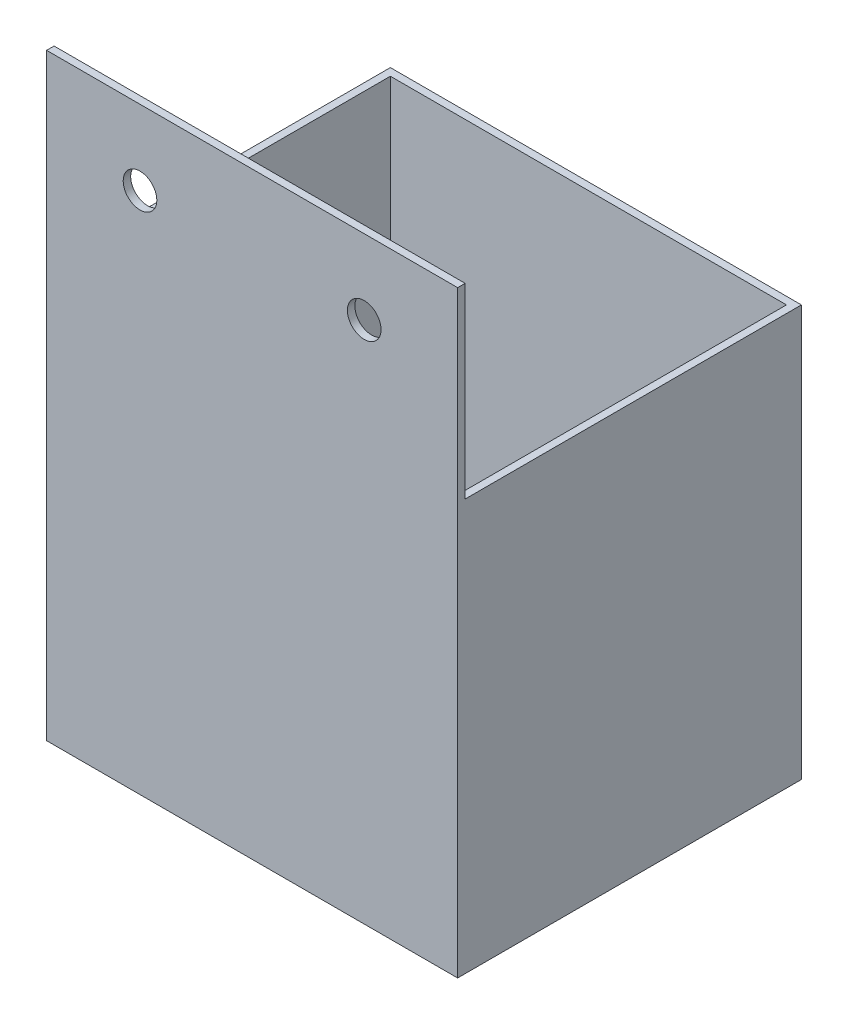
ISO-10303-21;
HEADER;
FILE_DESCRIPTION(('STEP AP214'),'2;1');
FILE_NAME('part.step','',(''),(''),'','','');
FILE_SCHEMA(('AUTOMOTIVE_DESIGN { 1 0 10303 214 1 1 1 1 }'));
ENDSEC;
DATA;
#1=APPLICATION_CONTEXT('core data for automotive mechanical design processes');
#2=APPLICATION_PROTOCOL_DEFINITION('international standard','automotive_design',2000,#1);
#3=PRODUCT_CONTEXT('',#1,'mechanical');
#4=PRODUCT('Part','Part','',(#3));
#5=PRODUCT_RELATED_PRODUCT_CATEGORY('part','',(#4));
#6=PRODUCT_DEFINITION_FORMATION('','',#4);
#7=PRODUCT_DEFINITION_CONTEXT('part definition',#1,'design');
#8=PRODUCT_DEFINITION('design','',#6,#7);
#9=PRODUCT_DEFINITION_SHAPE('','',#8);
#10=(LENGTH_UNIT() NAMED_UNIT(*) SI_UNIT(.MILLI.,.METRE.));
#11=(NAMED_UNIT(*) PLANE_ANGLE_UNIT() SI_UNIT($,.RADIAN.));
#12=(NAMED_UNIT(*) SI_UNIT($,.STERADIAN.) SOLID_ANGLE_UNIT());
#13=UNCERTAINTY_MEASURE_WITH_UNIT(LENGTH_MEASURE(1.E-05),#10,'distance_accuracy_value','');
#14=(GEOMETRIC_REPRESENTATION_CONTEXT(3) GLOBAL_UNCERTAINTY_ASSIGNED_CONTEXT((#13)) GLOBAL_UNIT_ASSIGNED_CONTEXT((#10,
#11,#12)) REPRESENTATION_CONTEXT('',''));
#15=CARTESIAN_POINT('',(0.,0.,0.));
#16=DIRECTION('',(0.,0.,1.));
#17=DIRECTION('',(1.,0.,0.));
#18=AXIS2_PLACEMENT_3D('',#15,#16,#17);
#19=CARTESIAN_POINT('',(55.,0.,0.));
#20=DIRECTION('',(0.,0.,1.));
#21=DIRECTION('',(1.,0.,0.));
#22=AXIS2_PLACEMENT_3D('',#19,#20,#21);
#23=PLANE('',#22);
#24=DIRECTION('',(1.,0.,0.));
#25=VECTOR('',#24,1.);
#26=CARTESIAN_POINT('',(0.,55.,0.));
#27=LINE('',#26,#25);
#28=CARTESIAN_POINT('',(0.,55.,0.));
#29=VERTEX_POINT('',#28);
#30=CARTESIAN_POINT('',(55.,55.,0.));
#31=VERTEX_POINT('',#30);
#32=EDGE_CURVE('E57',#29,#31,#27,.T.);
#33=ORIENTED_EDGE('',*,*,#32,.T.);
#34=DIRECTION('',(0.,1.,0.));
#35=VECTOR('',#34,1.);
#36=CARTESIAN_POINT('',(55.,0.,0.));
#37=LINE('',#36,#35);
#38=CARTESIAN_POINT('',(55.,0.,0.));
#39=VERTEX_POINT('',#38);
#40=EDGE_CURVE('E186',#39,#31,#37,.T.);
#41=ORIENTED_EDGE('',*,*,#40,.F.);
#42=DIRECTION('',(1.,0.,0.));
#43=VECTOR('',#42,1.);
#44=CARTESIAN_POINT('',(0.,2.27373675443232E-13,0.));
#45=LINE('',#44,#43);
#46=CARTESIAN_POINT('',(0.,2.27373675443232E-13,0.));
#47=VERTEX_POINT('',#46);
#48=EDGE_CURVE('E172',#47,#39,#45,.T.);
#49=ORIENTED_EDGE('',*,*,#48,.F.);
#50=DIRECTION('',(0.,-1.,0.));
#51=VECTOR('',#50,1.);
#52=CARTESIAN_POINT('',(0.,2.27373675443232E-13,0.));
#53=LINE('',#52,#51);
#54=EDGE_CURVE('E177',#29,#47,#53,.T.);
#55=ORIENTED_EDGE('',*,*,#54,.F.);
#56=EDGE_LOOP('',(#33,#41,#49,#55));
#57=FACE_BOUND('',#56,.T.);
#58=ADVANCED_FACE('F33',(#57),#23,.F.);
#59=CARTESIAN_POINT('',(55.,0.,46.));
#60=DIRECTION('',(-1.,0.,0.));
#61=DIRECTION('',(0.,0.,1.));
#62=AXIS2_PLACEMENT_3D('',#59,#60,#61);
#63=PLANE('',#62);
#64=DIRECTION('',(0.,1.,0.));
#65=VECTOR('',#64,1.);
#66=CARTESIAN_POINT('',(55.,55.,45.));
#67=LINE('',#66,#65);
#68=CARTESIAN_POINT('',(55.,55.,45.));
#69=VERTEX_POINT('',#68);
#70=CARTESIAN_POINT('',(55.,80.,45.));
#71=VERTEX_POINT('',#70);
#72=EDGE_CURVE('E150',#69,#71,#67,.T.);
#73=ORIENTED_EDGE('',*,*,#72,.T.);
#74=DIRECTION('',(0.,0.,-1.));
#75=VECTOR('',#74,1.);
#76=CARTESIAN_POINT('',(55.,80.,46.));
#77=LINE('',#76,#75);
#78=CARTESIAN_POINT('',(55.,80.,46.));
#79=VERTEX_POINT('',#78);
#80=EDGE_CURVE('E42',#79,#71,#77,.T.);
#81=ORIENTED_EDGE('',*,*,#80,.F.);
#82=DIRECTION('',(0.,1.,0.));
#83=VECTOR('',#82,1.);
#84=CARTESIAN_POINT('',(55.,0.,46.));
#85=LINE('',#84,#83);
#86=CARTESIAN_POINT('',(55.,0.,46.));
#87=VERTEX_POINT('',#86);
#88=EDGE_CURVE('E176',#87,#79,#85,.T.);
#89=ORIENTED_EDGE('',*,*,#88,.F.);
#90=DIRECTION('',(0.,0.,-1.));
#91=VECTOR('',#90,1.);
#92=CARTESIAN_POINT('',(55.,0.,46.));
#93=LINE('',#92,#91);
#94=EDGE_CURVE('E12',#87,#39,#93,.T.);
#95=ORIENTED_EDGE('',*,*,#94,.T.);
#96=ORIENTED_EDGE('',*,*,#40,.T.);
#97=DIRECTION('',(0.,0.,1.));
#98=VECTOR('',#97,1.);
#99=CARTESIAN_POINT('',(55.,55.,45.));
#100=LINE('',#99,#98);
#101=EDGE_CURVE('E127',#31,#69,#100,.T.);
#102=ORIENTED_EDGE('',*,*,#101,.T.);
#103=EDGE_LOOP('',(#73,#81,#89,#95,#96,#102));
#104=FACE_BOUND('',#103,.T.);
#105=ADVANCED_FACE('F203',(#104),#63,.F.);
#106=CARTESIAN_POINT('',(0.,80.,46.));
#107=DIRECTION('',(0.,-1.,0.));
#108=DIRECTION('',(0.,0.,-1.));
#109=AXIS2_PLACEMENT_3D('',#106,#107,#108);
#110=PLANE('',#109);
#111=DIRECTION('',(1.,0.,0.));
#112=VECTOR('',#111,1.);
#113=CARTESIAN_POINT('',(0.,80.,45.));
#114=LINE('',#113,#112);
#115=CARTESIAN_POINT('',(0.,80.,45.));
#116=VERTEX_POINT('',#115);
#117=EDGE_CURVE('E156',#116,#71,#114,.T.);
#118=ORIENTED_EDGE('',*,*,#117,.F.);
#119=DIRECTION('',(0.,0.,-1.));
#120=VECTOR('',#119,1.);
#121=CARTESIAN_POINT('',(0.,80.,46.));
#122=LINE('',#121,#120);
#123=CARTESIAN_POINT('',(0.,80.,46.));
#124=VERTEX_POINT('',#123);
#125=EDGE_CURVE('E192',#124,#116,#122,.T.);
#126=ORIENTED_EDGE('',*,*,#125,.F.);
#127=DIRECTION('',(-1.,0.,0.));
#128=VECTOR('',#127,1.);
#129=CARTESIAN_POINT('',(0.,80.,46.));
#130=LINE('',#129,#128);
#131=EDGE_CURVE('E179',#79,#124,#130,.T.);
#132=ORIENTED_EDGE('',*,*,#131,.F.);
#133=ORIENTED_EDGE('',*,*,#80,.T.);
#134=EDGE_LOOP('',(#118,#126,#132,#133));
#135=FACE_BOUND('',#134,.T.);
#136=ADVANCED_FACE('F200',(#135),#110,.F.);
#137=CARTESIAN_POINT('',(0.,2.27373675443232E-13,46.));
#138=DIRECTION('',(1.,0.,0.));
#139=DIRECTION('',(0.,0.,-1.));
#140=AXIS2_PLACEMENT_3D('',#137,#138,#139);
#141=PLANE('',#140);
#142=DIRECTION('',(0.,1.,0.));
#143=VECTOR('',#142,1.);
#144=CARTESIAN_POINT('',(0.,55.,45.));
#145=LINE('',#144,#143);
#146=CARTESIAN_POINT('',(0.,55.,45.));
#147=VERTEX_POINT('',#146);
#148=EDGE_CURVE('E149',#147,#116,#145,.T.);
#149=ORIENTED_EDGE('',*,*,#148,.F.);
#150=DIRECTION('',(0.,0.,1.));
#151=VECTOR('',#150,1.);
#152=CARTESIAN_POINT('',(0.,55.,45.));
#153=LINE('',#152,#151);
#154=EDGE_CURVE('E147',#29,#147,#153,.T.);
#155=ORIENTED_EDGE('',*,*,#154,.F.);
#156=ORIENTED_EDGE('',*,*,#54,.T.);
#157=DIRECTION('',(0.,0.,-1.));
#158=VECTOR('',#157,1.);
#159=CARTESIAN_POINT('',(0.,2.27373675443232E-13,46.));
#160=LINE('',#159,#158);
#161=CARTESIAN_POINT('',(0.,2.27373675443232E-13,46.));
#162=VERTEX_POINT('',#161);
#163=EDGE_CURVE('E183',#162,#47,#160,.T.);
#164=ORIENTED_EDGE('',*,*,#163,.F.);
#165=DIRECTION('',(0.,-1.,0.));
#166=VECTOR('',#165,1.);
#167=CARTESIAN_POINT('',(0.,2.27373675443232E-13,46.));
#168=LINE('',#167,#166);
#169=EDGE_CURVE('E181',#124,#162,#168,.T.);
#170=ORIENTED_EDGE('',*,*,#169,.F.);
#171=ORIENTED_EDGE('',*,*,#125,.T.);
#172=EDGE_LOOP('',(#149,#155,#156,#164,#170,#171));
#173=FACE_BOUND('',#172,.T.);
#174=ADVANCED_FACE('F211',(#173),#141,.F.);
#175=CARTESIAN_POINT('',(12.5,70.,46.));
#176=DIRECTION('',(0.,0.,-1.));
#177=DIRECTION('',(-1.,0.,0.));
#178=AXIS2_PLACEMENT_3D('',#175,#176,#177);
#179=CYLINDRICAL_SURFACE('',#178,2.25);
#180=CARTESIAN_POINT('',(12.5,70.,46.));
#181=DIRECTION('',(0.,0.,1.));
#182=DIRECTION('',(1.,0.,0.));
#183=AXIS2_PLACEMENT_3D('',#180,#181,#182);
#184=CIRCLE('',#183,2.25);
#185=CARTESIAN_POINT('',(14.75,70.,46.));
#186=VERTEX_POINT('',#185);
#187=EDGE_CURVE('E169',#186,#186,#184,.T.);
#188=ORIENTED_EDGE('',*,*,#187,.T.);
#189=EDGE_LOOP('',(#188));
#190=FACE_BOUND('',#189,.T.);
#191=CARTESIAN_POINT('',(12.5,70.,45.));
#192=DIRECTION('',(0.,0.,-1.));
#193=DIRECTION('',(-1.,0.,0.));
#194=AXIS2_PLACEMENT_3D('',#191,#192,#193);
#195=CIRCLE('',#194,2.25);
#196=CARTESIAN_POINT('',(10.25,70.,45.));
#197=VERTEX_POINT('',#196);
#198=EDGE_CURVE('E163',#197,#197,#195,.T.);
#199=ORIENTED_EDGE('',*,*,#198,.T.);
#200=EDGE_LOOP('',(#199));
#201=FACE_BOUND('',#200,.T.);
#202=ADVANCED_FACE('F233',(#190,#201),#179,.F.);
#203=CARTESIAN_POINT('',(42.5,70.,46.));
#204=DIRECTION('',(0.,0.,-1.));
#205=DIRECTION('',(-1.,0.,0.));
#206=AXIS2_PLACEMENT_3D('',#203,#204,#205);
#207=CYLINDRICAL_SURFACE('',#206,2.25);
#208=CARTESIAN_POINT('',(42.5,70.,46.));
#209=DIRECTION('',(0.,0.,1.));
#210=DIRECTION('',(1.,0.,0.));
#211=AXIS2_PLACEMENT_3D('',#208,#209,#210);
#212=CIRCLE('',#211,2.25);
#213=CARTESIAN_POINT('',(44.75,70.,46.));
#214=VERTEX_POINT('',#213);
#215=EDGE_CURVE('E166',#214,#214,#212,.T.);
#216=ORIENTED_EDGE('',*,*,#215,.T.);
#217=EDGE_LOOP('',(#216));
#218=FACE_BOUND('',#217,.T.);
#219=CARTESIAN_POINT('',(42.5,70.,45.));
#220=DIRECTION('',(0.,0.,-1.));
#221=DIRECTION('',(-1.,0.,0.));
#222=AXIS2_PLACEMENT_3D('',#219,#220,#221);
#223=CIRCLE('',#222,2.25);
#224=CARTESIAN_POINT('',(40.25,70.,45.));
#225=VERTEX_POINT('',#224);
#226=EDGE_CURVE('E37',#225,#225,#223,.T.);
#227=ORIENTED_EDGE('',*,*,#226,.T.);
#228=EDGE_LOOP('',(#227));
#229=FACE_BOUND('',#228,.T.);
#230=ADVANCED_FACE('F249',(#218,#229),#207,.F.);
#231=CARTESIAN_POINT('',(55.,0.,46.));
#232=DIRECTION('',(0.,0.,1.));
#233=DIRECTION('',(1.,0.,0.));
#234=AXIS2_PLACEMENT_3D('',#231,#232,#233);
#235=PLANE('',#234);
#236=ORIENTED_EDGE('',*,*,#187,.F.);
#237=EDGE_LOOP('',(#236));
#238=FACE_BOUND('',#237,.T.);
#239=DIRECTION('',(1.,0.,0.));
#240=VECTOR('',#239,1.);
#241=CARTESIAN_POINT('',(0.,2.27373675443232E-13,46.));
#242=LINE('',#241,#240);
#243=EDGE_CURVE('E173',#162,#87,#242,.T.);
#244=ORIENTED_EDGE('',*,*,#243,.T.);
#245=ORIENTED_EDGE('',*,*,#88,.T.);
#246=ORIENTED_EDGE('',*,*,#131,.T.);
#247=ORIENTED_EDGE('',*,*,#169,.T.);
#248=EDGE_LOOP('',(#244,#245,#246,#247));
#249=FACE_BOUND('',#248,.T.);
#250=ORIENTED_EDGE('',*,*,#215,.F.);
#251=EDGE_LOOP('',(#250));
#252=FACE_BOUND('',#251,.T.);
#253=ADVANCED_FACE('F217',(#238,#249,#252),#235,.T.);
#254=CARTESIAN_POINT('',(0.,2.27373675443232E-13,46.));
#255=DIRECTION('',(0.,1.,0.));
#256=DIRECTION('',(-1.,0.,0.));
#257=AXIS2_PLACEMENT_3D('',#254,#255,#256);
#258=PLANE('',#257);
#259=ORIENTED_EDGE('',*,*,#48,.T.);
#260=ORIENTED_EDGE('',*,*,#94,.F.);
#261=ORIENTED_EDGE('',*,*,#243,.F.);
#262=ORIENTED_EDGE('',*,*,#163,.T.);
#263=EDGE_LOOP('',(#259,#260,#261,#262));
#264=FACE_BOUND('',#263,.T.);
#265=ADVANCED_FACE('F35',(#264),#258,.F.);
#266=CARTESIAN_POINT('',(0.,55.,45.));
#267=DIRECTION('',(0.,0.,-1.));
#268=DIRECTION('',(-1.,0.,0.));
#269=AXIS2_PLACEMENT_3D('',#266,#267,#268);
#270=PLANE('',#269);
#271=ORIENTED_EDGE('',*,*,#198,.F.);
#272=EDGE_LOOP('',(#271));
#273=FACE_BOUND('',#272,.T.);
#274=ORIENTED_EDGE('',*,*,#226,.F.);
#275=EDGE_LOOP('',(#274));
#276=FACE_BOUND('',#275,.T.);
#277=ORIENTED_EDGE('',*,*,#72,.F.);
#278=DIRECTION('',(1.,0.,0.));
#279=VECTOR('',#278,1.);
#280=CARTESIAN_POINT('',(0.,55.,45.));
#281=LINE('',#280,#279);
#282=CARTESIAN_POINT('',(54.,55.,45.));
#283=VERTEX_POINT('',#282);
#284=EDGE_CURVE('E161',#283,#69,#281,.T.);
#285=ORIENTED_EDGE('',*,*,#284,.F.);
#286=DIRECTION('',(0.,1.,0.));
#287=VECTOR('',#286,1.);
#288=CARTESIAN_POINT('',(54.,0.,45.));
#289=LINE('',#288,#287);
#290=CARTESIAN_POINT('',(54.,1.,45.));
#291=VERTEX_POINT('',#290);
#292=EDGE_CURVE('E139',#291,#283,#289,.T.);
#293=ORIENTED_EDGE('',*,*,#292,.F.);
#294=DIRECTION('',(1.,0.,0.));
#295=VECTOR('',#294,1.);
#296=CARTESIAN_POINT('',(0.,1.00000000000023,45.));
#297=LINE('',#296,#295);
#298=CARTESIAN_POINT('',(1.,1.00000000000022,45.));
#299=VERTEX_POINT('',#298);
#300=EDGE_CURVE('E126',#299,#291,#297,.T.);
#301=ORIENTED_EDGE('',*,*,#300,.F.);
#302=DIRECTION('',(0.,-1.,0.));
#303=VECTOR('',#302,1.);
#304=CARTESIAN_POINT('',(1.,2.27373675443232E-13,45.));
#305=LINE('',#304,#303);
#306=CARTESIAN_POINT('',(1.,55.,45.));
#307=VERTEX_POINT('',#306);
#308=EDGE_CURVE('E140',#307,#299,#305,.T.);
#309=ORIENTED_EDGE('',*,*,#308,.F.);
#310=EDGE_CURVE('E158',#147,#307,#281,.T.);
#311=ORIENTED_EDGE('',*,*,#310,.F.);
#312=ORIENTED_EDGE('',*,*,#148,.T.);
#313=ORIENTED_EDGE('',*,*,#117,.T.);
#314=EDGE_LOOP('',(#277,#285,#293,#301,#309,#311,#312,#313));
#315=FACE_BOUND('',#314,.T.);
#316=ADVANCED_FACE('F207',(#273,#276,#315),#270,.T.);
#317=CARTESIAN_POINT('',(0.,55.,45.));
#318=DIRECTION('',(0.,1.,0.));
#319=DIRECTION('',(0.,0.,1.));
#320=AXIS2_PLACEMENT_3D('',#317,#318,#319);
#321=PLANE('',#320);
#322=DIRECTION('',(0.,0.,1.));
#323=VECTOR('',#322,1.);
#324=CARTESIAN_POINT('',(1.,55.,46.));
#325=LINE('',#324,#323);
#326=CARTESIAN_POINT('',(1.,55.,1.));
#327=VERTEX_POINT('',#326);
#328=EDGE_CURVE('E135',#327,#307,#325,.T.);
#329=ORIENTED_EDGE('',*,*,#328,.F.);
#330=DIRECTION('',(1.,0.,0.));
#331=VECTOR('',#330,1.);
#332=CARTESIAN_POINT('',(0.,55.,1.));
#333=LINE('',#332,#331);
#334=CARTESIAN_POINT('',(54.,55.,1.));
#335=VERTEX_POINT('',#334);
#336=EDGE_CURVE('E133',#327,#335,#333,.T.);
#337=ORIENTED_EDGE('',*,*,#336,.T.);
#338=DIRECTION('',(0.,0.,1.));
#339=VECTOR('',#338,1.);
#340=CARTESIAN_POINT('',(54.,55.,45.));
#341=LINE('',#340,#339);
#342=EDGE_CURVE('E115',#335,#283,#341,.T.);
#343=ORIENTED_EDGE('',*,*,#342,.T.);
#344=ORIENTED_EDGE('',*,*,#284,.T.);
#345=ORIENTED_EDGE('',*,*,#101,.F.);
#346=ORIENTED_EDGE('',*,*,#32,.F.);
#347=ORIENTED_EDGE('',*,*,#154,.T.);
#348=ORIENTED_EDGE('',*,*,#310,.T.);
#349=EDGE_LOOP('',(#329,#337,#343,#344,#345,#346,#347,#348));
#350=FACE_BOUND('',#349,.T.);
#351=ADVANCED_FACE('F274',(#350),#321,.T.);
#352=CARTESIAN_POINT('',(55.,0.,1.));
#353=DIRECTION('',(0.,0.,1.));
#354=DIRECTION('',(1.,0.,0.));
#355=AXIS2_PLACEMENT_3D('',#352,#353,#354);
#356=PLANE('',#355);
#357=ORIENTED_EDGE('',*,*,#336,.F.);
#358=DIRECTION('',(0.,-1.,0.));
#359=VECTOR('',#358,1.);
#360=CARTESIAN_POINT('',(1.,2.27373675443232E-13,1.));
#361=LINE('',#360,#359);
#362=CARTESIAN_POINT('',(1.,1.00000000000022,1.));
#363=VERTEX_POINT('',#362);
#364=EDGE_CURVE('E117',#327,#363,#361,.T.);
#365=ORIENTED_EDGE('',*,*,#364,.T.);
#366=DIRECTION('',(1.,0.,0.));
#367=VECTOR('',#366,1.);
#368=CARTESIAN_POINT('',(0.,1.00000000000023,1.));
#369=LINE('',#368,#367);
#370=CARTESIAN_POINT('',(54.,1.,1.));
#371=VERTEX_POINT('',#370);
#372=EDGE_CURVE('E118',#363,#371,#369,.T.);
#373=ORIENTED_EDGE('',*,*,#372,.T.);
#374=DIRECTION('',(0.,1.,0.));
#375=VECTOR('',#374,1.);
#376=CARTESIAN_POINT('',(54.,0.,1.));
#377=LINE('',#376,#375);
#378=EDGE_CURVE('E49',#371,#335,#377,.T.);
#379=ORIENTED_EDGE('',*,*,#378,.T.);
#380=EDGE_LOOP('',(#357,#365,#373,#379));
#381=FACE_BOUND('',#380,.T.);
#382=ADVANCED_FACE('F130',(#381),#356,.T.);
#383=CARTESIAN_POINT('',(54.,0.,46.));
#384=DIRECTION('',(-1.,0.,0.));
#385=DIRECTION('',(0.,0.,1.));
#386=AXIS2_PLACEMENT_3D('',#383,#384,#385);
#387=PLANE('',#386);
#388=ORIENTED_EDGE('',*,*,#342,.F.);
#389=ORIENTED_EDGE('',*,*,#378,.F.);
#390=DIRECTION('',(0.,0.,-1.));
#391=VECTOR('',#390,1.);
#392=CARTESIAN_POINT('',(54.,1.,46.));
#393=LINE('',#392,#391);
#394=EDGE_CURVE('E113',#291,#371,#393,.T.);
#395=ORIENTED_EDGE('',*,*,#394,.F.);
#396=ORIENTED_EDGE('',*,*,#292,.T.);
#397=EDGE_LOOP('',(#388,#389,#395,#396));
#398=FACE_BOUND('',#397,.T.);
#399=ADVANCED_FACE('F112',(#398),#387,.T.);
#400=CARTESIAN_POINT('',(1.,2.27373675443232E-13,46.));
#401=DIRECTION('',(1.,0.,0.));
#402=DIRECTION('',(0.,0.,-1.));
#403=AXIS2_PLACEMENT_3D('',#400,#401,#402);
#404=PLANE('',#403);
#405=ORIENTED_EDGE('',*,*,#308,.T.);
#406=DIRECTION('',(0.,0.,-1.));
#407=VECTOR('',#406,1.);
#408=CARTESIAN_POINT('',(1.,1.00000000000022,46.));
#409=LINE('',#408,#407);
#410=EDGE_CURVE('E128',#299,#363,#409,.T.);
#411=ORIENTED_EDGE('',*,*,#410,.T.);
#412=ORIENTED_EDGE('',*,*,#364,.F.);
#413=ORIENTED_EDGE('',*,*,#328,.T.);
#414=EDGE_LOOP('',(#405,#411,#412,#413));
#415=FACE_BOUND('',#414,.T.);
#416=ADVANCED_FACE('F294',(#415),#404,.T.);
#417=CARTESIAN_POINT('',(0.,1.00000000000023,46.));
#418=DIRECTION('',(0.,1.,0.));
#419=DIRECTION('',(-1.,0.,0.));
#420=AXIS2_PLACEMENT_3D('',#417,#418,#419);
#421=PLANE('',#420);
#422=ORIENTED_EDGE('',*,*,#372,.F.);
#423=ORIENTED_EDGE('',*,*,#410,.F.);
#424=ORIENTED_EDGE('',*,*,#300,.T.);
#425=ORIENTED_EDGE('',*,*,#394,.T.);
#426=EDGE_LOOP('',(#422,#423,#424,#425));
#427=FACE_BOUND('',#426,.T.);
#428=ADVANCED_FACE('F123',(#427),#421,.T.);
#429=CLOSED_SHELL('',(#58,#105,#136,#174,#202,#230,#253,#265,#316,#351,#382,#399,#416,#428));
#430=MANIFOLD_SOLID_BREP('B2',#429);
#431=ADVANCED_BREP_SHAPE_REPRESENTATION('',(#18,#430),#14);
#432=SHAPE_DEFINITION_REPRESENTATION(#9,#431);
ENDSEC;
END-ISO-10303-21;
